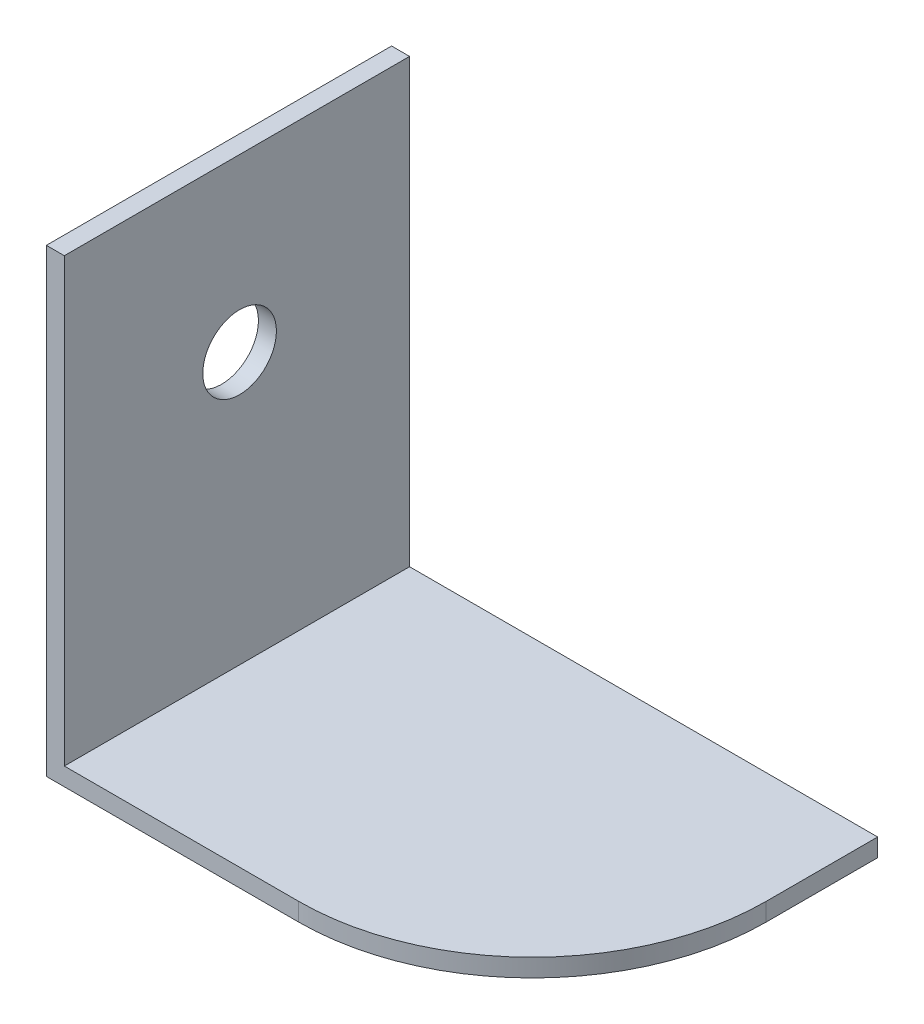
ISO-10303-21;
HEADER;
FILE_DESCRIPTION(('STEP AP214'),'2;1');
FILE_NAME('part.step','',(''),(''),'','','');
FILE_SCHEMA(('AUTOMOTIVE_DESIGN { 1 0 10303 214 1 1 1 1 }'));
ENDSEC;
DATA;
#1=APPLICATION_CONTEXT('core data for automotive mechanical design processes');
#2=APPLICATION_PROTOCOL_DEFINITION('international standard','automotive_design',2000,#1);
#3=PRODUCT_CONTEXT('',#1,'mechanical');
#4=PRODUCT('Part','Part','',(#3));
#5=PRODUCT_RELATED_PRODUCT_CATEGORY('part','',(#4));
#6=PRODUCT_DEFINITION_FORMATION('','',#4);
#7=PRODUCT_DEFINITION_CONTEXT('part definition',#1,'design');
#8=PRODUCT_DEFINITION('design','',#6,#7);
#9=PRODUCT_DEFINITION_SHAPE('','',#8);
#10=(LENGTH_UNIT() NAMED_UNIT(*) SI_UNIT(.MILLI.,.METRE.));
#11=(NAMED_UNIT(*) PLANE_ANGLE_UNIT() SI_UNIT($,.RADIAN.));
#12=(NAMED_UNIT(*) SI_UNIT($,.STERADIAN.) SOLID_ANGLE_UNIT());
#13=UNCERTAINTY_MEASURE_WITH_UNIT(LENGTH_MEASURE(1.E-05),#10,'distance_accuracy_value','');
#14=(GEOMETRIC_REPRESENTATION_CONTEXT(3) GLOBAL_UNCERTAINTY_ASSIGNED_CONTEXT((#13)) GLOBAL_UNIT_ASSIGNED_CONTEXT((#10,
#11,#12)) REPRESENTATION_CONTEXT('',''));
#15=CARTESIAN_POINT('',(0.,0.,0.));
#16=DIRECTION('',(0.,0.,1.));
#17=DIRECTION('',(1.,0.,0.));
#18=AXIS2_PLACEMENT_3D('',#15,#16,#17);
#19=CARTESIAN_POINT('',(0.,0.,48.768));
#20=DIRECTION('',(0.,1.,0.));
#21=DIRECTION('',(0.,0.,1.));
#22=AXIS2_PLACEMENT_3D('',#19,#20,#21);
#23=PLANE('',#22);
#24=DIRECTION('',(0.,0.,-1.));
#25=VECTOR('',#24,1.);
#26=CARTESIAN_POINT('',(68.660777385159,0.,48.768));
#27=LINE('',#26,#25);
#28=CARTESIAN_POINT('',(68.660777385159,0.,15.748));
#29=VERTEX_POINT('',#28);
#30=CARTESIAN_POINT('',(68.660777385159,0.,0.));
#31=VERTEX_POINT('',#30);
#32=EDGE_CURVE('E85',#29,#31,#27,.T.);
#33=ORIENTED_EDGE('',*,*,#32,.F.);
#34=CARTESIAN_POINT('',(35.640777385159,0.,15.748));
#35=DIRECTION('',(0.,1.,0.));
#36=DIRECTION('',(0.,0.,1.));
#37=AXIS2_PLACEMENT_3D('',#34,#35,#36);
#38=CIRCLE('',#37,33.02);
#39=CARTESIAN_POINT('',(35.640777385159,0.,48.768));
#40=VERTEX_POINT('',#39);
#41=EDGE_CURVE('E48',#29,#40,#38,.F.);
#42=ORIENTED_EDGE('',*,*,#41,.T.);
#43=DIRECTION('',(1.,0.,0.));
#44=VECTOR('',#43,1.);
#45=CARTESIAN_POINT('',(0.,0.,48.768));
#46=LINE('',#45,#44);
#47=CARTESIAN_POINT('',(0.,0.,48.768));
#48=VERTEX_POINT('',#47);
#49=EDGE_CURVE('E120',#48,#40,#46,.T.);
#50=ORIENTED_EDGE('',*,*,#49,.F.);
#51=DIRECTION('',(0.,0.,-1.));
#52=VECTOR('',#51,1.);
#53=CARTESIAN_POINT('',(0.,0.,48.768));
#54=LINE('',#53,#52);
#55=CARTESIAN_POINT('',(0.,0.,0.));
#56=VERTEX_POINT('',#55);
#57=EDGE_CURVE('E100',#48,#56,#54,.T.);
#58=ORIENTED_EDGE('',*,*,#57,.T.);
#59=DIRECTION('',(1.,0.,0.));
#60=VECTOR('',#59,1.);
#61=CARTESIAN_POINT('',(0.,0.,0.));
#62=LINE('',#61,#60);
#63=EDGE_CURVE('E98',#56,#31,#62,.T.);
#64=ORIENTED_EDGE('',*,*,#63,.T.);
#65=EDGE_LOOP('',(#33,#42,#50,#58,#64));
#66=FACE_BOUND('',#65,.T.);
#67=ADVANCED_FACE('F27',(#66),#23,.F.);
#68=CARTESIAN_POINT('',(68.660777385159,2.54,48.768));
#69=DIRECTION('',(1.,0.,0.));
#70=DIRECTION('',(0.,0.,-1.));
#71=AXIS2_PLACEMENT_3D('',#68,#69,#70);
#72=PLANE('',#71);
#73=DIRECTION('',(0.,0.,-1.));
#74=VECTOR('',#73,1.);
#75=CARTESIAN_POINT('',(68.660777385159,2.54,48.768));
#76=LINE('',#75,#74);
#77=CARTESIAN_POINT('',(68.660777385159,2.54,15.748));
#78=VERTEX_POINT('',#77);
#79=CARTESIAN_POINT('',(68.660777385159,2.54,0.));
#80=VERTEX_POINT('',#79);
#81=EDGE_CURVE('E94',#78,#80,#76,.T.);
#82=ORIENTED_EDGE('',*,*,#81,.F.);
#83=DIRECTION('',(0.,-1.,0.));
#84=VECTOR('',#83,1.);
#85=CARTESIAN_POINT('',(68.660777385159,0.,15.748));
#86=LINE('',#85,#84);
#87=EDGE_CURVE('E93',#78,#29,#86,.T.);
#88=ORIENTED_EDGE('',*,*,#87,.T.);
#89=ORIENTED_EDGE('',*,*,#32,.T.);
#90=DIRECTION('',(0.,-1.,0.));
#91=VECTOR('',#90,1.);
#92=CARTESIAN_POINT('',(68.660777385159,2.54,0.));
#93=LINE('',#92,#91);
#94=EDGE_CURVE('E90',#80,#31,#93,.T.);
#95=ORIENTED_EDGE('',*,*,#94,.F.);
#96=EDGE_LOOP('',(#82,#88,#89,#95));
#97=FACE_BOUND('',#96,.T.);
#98=ADVANCED_FACE('F88',(#97),#72,.T.);
#99=CARTESIAN_POINT('',(0.,2.54,48.768));
#100=DIRECTION('',(0.,1.,0.));
#101=DIRECTION('',(0.,0.,1.));
#102=AXIS2_PLACEMENT_3D('',#99,#100,#101);
#103=PLANE('',#102);
#104=DIRECTION('',(1.,0.,0.));
#105=VECTOR('',#104,1.);
#106=CARTESIAN_POINT('',(0.,2.54,48.768));
#107=LINE('',#106,#105);
#108=CARTESIAN_POINT('',(2.54,2.54,48.768));
#109=VERTEX_POINT('',#108);
#110=CARTESIAN_POINT('',(35.640777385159,2.54,48.768));
#111=VERTEX_POINT('',#110);
#112=EDGE_CURVE('E122',#109,#111,#107,.T.);
#113=ORIENTED_EDGE('',*,*,#112,.T.);
#114=CARTESIAN_POINT('',(35.640777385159,2.54,15.748));
#115=DIRECTION('',(0.,1.,0.));
#116=DIRECTION('',(0.,0.,1.));
#117=AXIS2_PLACEMENT_3D('',#114,#115,#116);
#118=CIRCLE('',#117,33.02);
#119=EDGE_CURVE('E11',#111,#78,#118,.T.);
#120=ORIENTED_EDGE('',*,*,#119,.T.);
#121=ORIENTED_EDGE('',*,*,#81,.T.);
#122=DIRECTION('',(1.,0.,0.));
#123=VECTOR('',#122,1.);
#124=CARTESIAN_POINT('',(0.,2.54,0.));
#125=LINE('',#124,#123);
#126=CARTESIAN_POINT('',(2.54,2.54,0.));
#127=VERTEX_POINT('',#126);
#128=EDGE_CURVE('E108',#127,#80,#125,.T.);
#129=ORIENTED_EDGE('',*,*,#128,.F.);
#130=DIRECTION('',(0.,0.,-1.));
#131=VECTOR('',#130,1.);
#132=CARTESIAN_POINT('',(2.54,2.54,48.768));
#133=LINE('',#132,#131);
#134=EDGE_CURVE('E137',#109,#127,#133,.T.);
#135=ORIENTED_EDGE('',*,*,#134,.F.);
#136=EDGE_LOOP('',(#113,#120,#121,#129,#135));
#137=FACE_BOUND('',#136,.T.);
#138=ADVANCED_FACE('F142',(#137),#103,.T.);
#139=CARTESIAN_POINT('',(2.54,64.9734393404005,48.768));
#140=DIRECTION('',(1.,0.,0.));
#141=DIRECTION('',(0.,0.,-1.));
#142=AXIS2_PLACEMENT_3D('',#139,#140,#141);
#143=PLANE('',#142);
#144=CARTESIAN_POINT('',(2.54,40.7938382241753,24.0117340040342));
#145=DIRECTION('',(1.,0.,0.));
#146=DIRECTION('',(0.,0.,-1.));
#147=AXIS2_PLACEMENT_3D('',#144,#145,#146);
#148=CIRCLE('',#147,5.19980387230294);
#149=CARTESIAN_POINT('',(2.54,40.7938382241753,18.8119301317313));
#150=VERTEX_POINT('',#149);
#151=EDGE_CURVE('E222',#150,#150,#148,.T.);
#152=ORIENTED_EDGE('',*,*,#151,.F.);
#153=EDGE_LOOP('',(#152));
#154=FACE_BOUND('',#153,.T.);
#155=DIRECTION('',(0.,1.,0.));
#156=VECTOR('',#155,1.);
#157=CARTESIAN_POINT('',(2.54,64.9734393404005,0.));
#158=LINE('',#157,#156);
#159=CARTESIAN_POINT('',(2.54,64.9734393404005,0.));
#160=VERTEX_POINT('',#159);
#161=EDGE_CURVE('E110',#160,#127,#158,.F.);
#162=ORIENTED_EDGE('',*,*,#161,.F.);
#163=DIRECTION('',(0.,0.,-1.));
#164=VECTOR('',#163,1.);
#165=CARTESIAN_POINT('',(2.54,64.9734393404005,48.768));
#166=LINE('',#165,#164);
#167=CARTESIAN_POINT('',(2.54,64.9734393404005,48.768));
#168=VERTEX_POINT('',#167);
#169=EDGE_CURVE('E135',#168,#160,#166,.T.);
#170=ORIENTED_EDGE('',*,*,#169,.F.);
#171=DIRECTION('',(0.,1.,0.));
#172=VECTOR('',#171,1.);
#173=CARTESIAN_POINT('',(2.54,64.9734393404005,48.768));
#174=LINE('',#173,#172);
#175=EDGE_CURVE('E124',#168,#109,#174,.F.);
#176=ORIENTED_EDGE('',*,*,#175,.T.);
#177=ORIENTED_EDGE('',*,*,#134,.T.);
#178=EDGE_LOOP('',(#162,#170,#176,#177));
#179=FACE_BOUND('',#178,.T.);
#180=ADVANCED_FACE('F162',(#154,#179),#143,.T.);
#181=CARTESIAN_POINT('',(0.,64.9734393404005,48.768));
#182=DIRECTION('',(0.,1.,0.));
#183=DIRECTION('',(0.,0.,1.));
#184=AXIS2_PLACEMENT_3D('',#181,#182,#183);
#185=PLANE('',#184);
#186=DIRECTION('',(1.,0.,0.));
#187=VECTOR('',#186,1.);
#188=CARTESIAN_POINT('',(0.,64.9734393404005,0.));
#189=LINE('',#188,#187);
#190=CARTESIAN_POINT('',(0.,64.9734393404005,0.));
#191=VERTEX_POINT('',#190);
#192=EDGE_CURVE('E115',#191,#160,#189,.T.);
#193=ORIENTED_EDGE('',*,*,#192,.F.);
#194=DIRECTION('',(0.,0.,-1.));
#195=VECTOR('',#194,1.);
#196=CARTESIAN_POINT('',(0.,64.9734393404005,48.768));
#197=LINE('',#196,#195);
#198=CARTESIAN_POINT('',(0.,64.9734393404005,48.768));
#199=VERTEX_POINT('',#198);
#200=EDGE_CURVE('E133',#199,#191,#197,.T.);
#201=ORIENTED_EDGE('',*,*,#200,.F.);
#202=DIRECTION('',(1.,0.,0.));
#203=VECTOR('',#202,1.);
#204=CARTESIAN_POINT('',(0.,64.9734393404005,48.768));
#205=LINE('',#204,#203);
#206=EDGE_CURVE('E127',#199,#168,#205,.T.);
#207=ORIENTED_EDGE('',*,*,#206,.T.);
#208=ORIENTED_EDGE('',*,*,#169,.T.);
#209=EDGE_LOOP('',(#193,#201,#207,#208));
#210=FACE_BOUND('',#209,.T.);
#211=ADVANCED_FACE('F167',(#210),#185,.T.);
#212=CARTESIAN_POINT('',(0.,64.9734393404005,48.768));
#213=DIRECTION('',(1.,0.,0.));
#214=DIRECTION('',(0.,0.,-1.));
#215=AXIS2_PLACEMENT_3D('',#212,#213,#214);
#216=PLANE('',#215);
#217=CARTESIAN_POINT('',(0.,40.7938382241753,24.0117340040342));
#218=DIRECTION('',(1.,0.,0.));
#219=DIRECTION('',(0.,0.,-1.));
#220=AXIS2_PLACEMENT_3D('',#217,#218,#219);
#221=CIRCLE('',#220,5.19980387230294);
#222=CARTESIAN_POINT('',(0.,40.7938382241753,18.8119301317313));
#223=VERTEX_POINT('',#222);
#224=EDGE_CURVE('E103',#223,#223,#221,.T.);
#225=ORIENTED_EDGE('',*,*,#224,.T.);
#226=EDGE_LOOP('',(#225));
#227=FACE_BOUND('',#226,.T.);
#228=DIRECTION('',(0.,-1.,0.));
#229=VECTOR('',#228,1.);
#230=CARTESIAN_POINT('',(0.,64.9734393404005,0.));
#231=LINE('',#230,#229);
#232=EDGE_CURVE('E118',#191,#56,#231,.T.);
#233=ORIENTED_EDGE('',*,*,#232,.T.);
#234=ORIENTED_EDGE('',*,*,#57,.F.);
#235=DIRECTION('',(0.,-1.,0.));
#236=VECTOR('',#235,1.);
#237=CARTESIAN_POINT('',(0.,64.9734393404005,48.768));
#238=LINE('',#237,#236);
#239=EDGE_CURVE('E130',#199,#48,#238,.T.);
#240=ORIENTED_EDGE('',*,*,#239,.F.);
#241=ORIENTED_EDGE('',*,*,#200,.T.);
#242=EDGE_LOOP('',(#233,#234,#240,#241));
#243=FACE_BOUND('',#242,.T.);
#244=ADVANCED_FACE('F171',(#227,#243),#216,.F.);
#245=CARTESIAN_POINT('',(68.660777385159,0.,48.768));
#246=DIRECTION('',(0.,0.,-1.));
#247=DIRECTION('',(-1.,0.,0.));
#248=AXIS2_PLACEMENT_3D('',#245,#246,#247);
#249=PLANE('',#248);
#250=ORIENTED_EDGE('',*,*,#49,.T.);
#251=DIRECTION('',(0.,-1.,0.));
#252=VECTOR('',#251,1.);
#253=CARTESIAN_POINT('',(35.640777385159,2.54,48.768));
#254=LINE('',#253,#252);
#255=EDGE_CURVE('E34',#40,#111,#254,.F.);
#256=ORIENTED_EDGE('',*,*,#255,.T.);
#257=ORIENTED_EDGE('',*,*,#112,.F.);
#258=ORIENTED_EDGE('',*,*,#175,.F.);
#259=ORIENTED_EDGE('',*,*,#206,.F.);
#260=ORIENTED_EDGE('',*,*,#239,.T.);
#261=EDGE_LOOP('',(#250,#256,#257,#258,#259,#260));
#262=FACE_BOUND('',#261,.T.);
#263=ADVANCED_FACE('F175',(#262),#249,.F.);
#264=CARTESIAN_POINT('',(68.660777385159,0.,0.));
#265=DIRECTION('',(0.,0.,-1.));
#266=DIRECTION('',(-1.,0.,0.));
#267=AXIS2_PLACEMENT_3D('',#264,#265,#266);
#268=PLANE('',#267);
#269=ORIENTED_EDGE('',*,*,#63,.F.);
#270=ORIENTED_EDGE('',*,*,#232,.F.);
#271=ORIENTED_EDGE('',*,*,#192,.T.);
#272=ORIENTED_EDGE('',*,*,#161,.T.);
#273=ORIENTED_EDGE('',*,*,#128,.T.);
#274=ORIENTED_EDGE('',*,*,#94,.T.);
#275=EDGE_LOOP('',(#269,#270,#271,#272,#273,#274));
#276=FACE_BOUND('',#275,.T.);
#277=ADVANCED_FACE('F105',(#276),#268,.T.);
#278=CARTESIAN_POINT('',(0.,40.7938382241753,24.0117340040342));
#279=DIRECTION('',(1.,0.,0.));
#280=DIRECTION('',(0.,0.,-1.));
#281=AXIS2_PLACEMENT_3D('',#278,#279,#280);
#282=CYLINDRICAL_SURFACE('',#281,5.19980387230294);
#283=ORIENTED_EDGE('',*,*,#224,.F.);
#284=EDGE_LOOP('',(#283));
#285=FACE_BOUND('',#284,.T.);
#286=ORIENTED_EDGE('',*,*,#151,.T.);
#287=EDGE_LOOP('',(#286));
#288=FACE_BOUND('',#287,.T.);
#289=ADVANCED_FACE('F147',(#285,#288),#282,.F.);
#290=CARTESIAN_POINT('',(35.640777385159,2.54,15.748));
#291=DIRECTION('',(0.,1.,0.));
#292=DIRECTION('',(0.,0.,1.));
#293=AXIS2_PLACEMENT_3D('',#290,#291,#292);
#294=CYLINDRICAL_SURFACE('',#293,33.02);
#295=ORIENTED_EDGE('',*,*,#119,.F.);
#296=ORIENTED_EDGE('',*,*,#255,.F.);
#297=ORIENTED_EDGE('',*,*,#41,.F.);
#298=ORIENTED_EDGE('',*,*,#87,.F.);
#299=EDGE_LOOP('',(#295,#296,#297,#298));
#300=FACE_BOUND('',#299,.T.);
#301=ADVANCED_FACE('F145',(#300),#294,.T.);
#302=CLOSED_SHELL('',(#67,#98,#138,#180,#211,#244,#263,#277,#289,#301));
#303=MANIFOLD_SOLID_BREP('B2',#302);
#304=ADVANCED_BREP_SHAPE_REPRESENTATION('',(#18,#303),#14);
#305=SHAPE_DEFINITION_REPRESENTATION(#9,#304);
ENDSEC;
END-ISO-10303-21;
